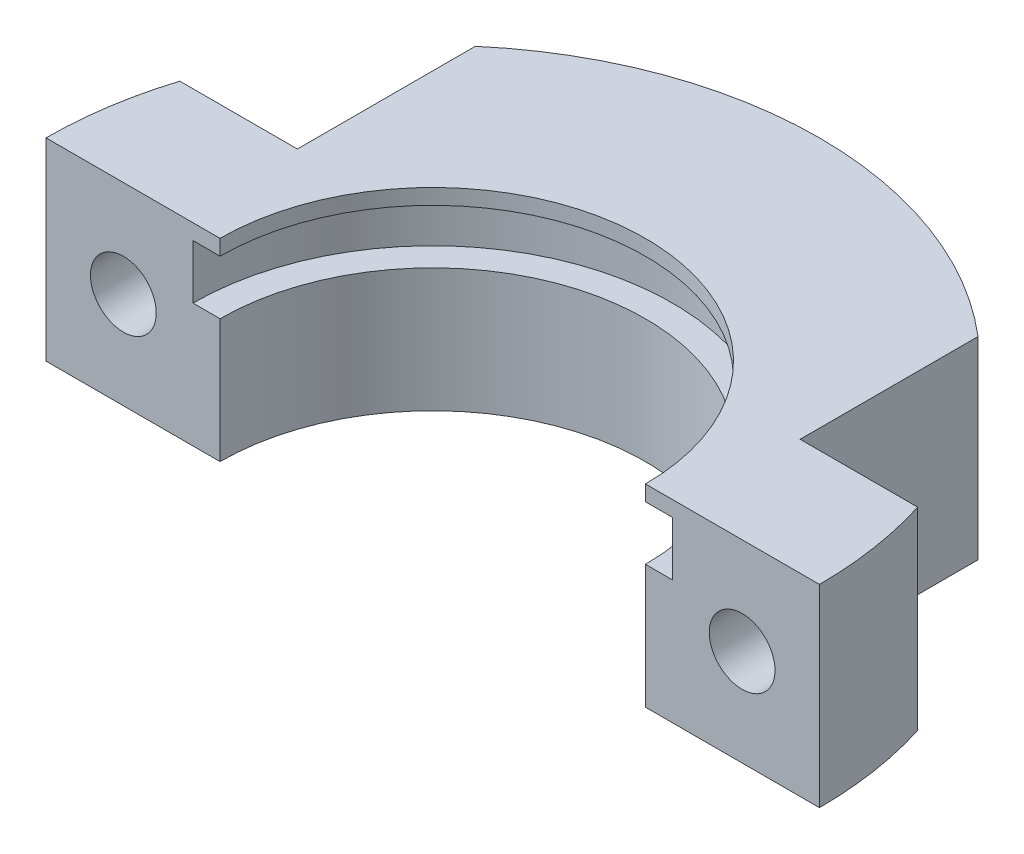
ISO-10303-21;
HEADER;
FILE_DESCRIPTION(('STEP AP214'),'2;1');
FILE_NAME('part.step','',(''),(''),'','','');
FILE_SCHEMA(('AUTOMOTIVE_DESIGN { 1 0 10303 214 1 1 1 1 }'));
ENDSEC;
DATA;
#1=APPLICATION_CONTEXT('core data for automotive mechanical design processes');
#2=APPLICATION_PROTOCOL_DEFINITION('international standard','automotive_design',2000,#1);
#3=PRODUCT_CONTEXT('',#1,'mechanical');
#4=PRODUCT('Part','Part','',(#3));
#5=PRODUCT_RELATED_PRODUCT_CATEGORY('part','',(#4));
#6=PRODUCT_DEFINITION_FORMATION('','',#4);
#7=PRODUCT_DEFINITION_CONTEXT('part definition',#1,'design');
#8=PRODUCT_DEFINITION('design','',#6,#7);
#9=PRODUCT_DEFINITION_SHAPE('','',#8);
#10=(LENGTH_UNIT() NAMED_UNIT(*) SI_UNIT(.MILLI.,.METRE.));
#11=(NAMED_UNIT(*) PLANE_ANGLE_UNIT() SI_UNIT($,.RADIAN.));
#12=(NAMED_UNIT(*) SI_UNIT($,.STERADIAN.) SOLID_ANGLE_UNIT());
#13=UNCERTAINTY_MEASURE_WITH_UNIT(LENGTH_MEASURE(1.E-05),#10,'distance_accuracy_value','');
#14=(GEOMETRIC_REPRESENTATION_CONTEXT(3) GLOBAL_UNCERTAINTY_ASSIGNED_CONTEXT((#13)) GLOBAL_UNIT_ASSIGNED_CONTEXT((#10,
#11,#12)) REPRESENTATION_CONTEXT('',''));
#15=CARTESIAN_POINT('',(0.,0.,0.));
#16=DIRECTION('',(0.,0.,1.));
#17=DIRECTION('',(1.,0.,0.));
#18=AXIS2_PLACEMENT_3D('',#15,#16,#17);
#19=CARTESIAN_POINT('',(0.,50.,0.));
#20=DIRECTION('',(0.,-1.,0.));
#21=DIRECTION('',(0.,0.,-1.));
#22=AXIS2_PLACEMENT_3D('',#19,#20,#21);
#23=CYLINDRICAL_SURFACE('',#22,100.);
#24=DIRECTION('',(0.,-1.,0.));
#25=VECTOR('',#24,1.);
#26=CARTESIAN_POINT('',(-65.,50.,-75.9934207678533));
#27=LINE('',#26,#25);
#28=CARTESIAN_POINT('',(-65.,0.,-75.9934207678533));
#29=VERTEX_POINT('',#28);
#30=CARTESIAN_POINT('',(-65.,50.,-75.9934207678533));
#31=VERTEX_POINT('',#30);
#32=EDGE_CURVE('E134',#29,#31,#27,.F.);
#33=ORIENTED_EDGE('',*,*,#32,.T.);
#34=CARTESIAN_POINT('',(0.,50.,0.));
#35=DIRECTION('',(0.,1.,0.));
#36=DIRECTION('',(0.,0.,1.));
#37=AXIS2_PLACEMENT_3D('',#34,#35,#36);
#38=CIRCLE('',#37,100.);
#39=CARTESIAN_POINT('',(65.,50.,-75.9934207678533));
#40=VERTEX_POINT('',#39);
#41=EDGE_CURVE('E145',#40,#31,#38,.T.);
#42=ORIENTED_EDGE('',*,*,#41,.F.);
#43=DIRECTION('',(0.,-1.,0.));
#44=VECTOR('',#43,1.);
#45=CARTESIAN_POINT('',(65.,50.,-75.9934207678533));
#46=LINE('',#45,#44);
#47=CARTESIAN_POINT('',(65.,0.,-75.9934207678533));
#48=VERTEX_POINT('',#47);
#49=EDGE_CURVE('E248',#48,#40,#46,.F.);
#50=ORIENTED_EDGE('',*,*,#49,.F.);
#51=CARTESIAN_POINT('',(0.,0.,0.));
#52=DIRECTION('',(0.,1.,0.));
#53=DIRECTION('',(0.,0.,1.));
#54=AXIS2_PLACEMENT_3D('',#51,#52,#53);
#55=CIRCLE('',#54,100.);
#56=EDGE_CURVE('E147',#48,#29,#55,.T.);
#57=ORIENTED_EDGE('',*,*,#56,.T.);
#58=EDGE_LOOP('',(#33,#42,#50,#57));
#59=FACE_BOUND('',#58,.T.);
#60=ADVANCED_FACE('F32',(#59),#23,.T.);
#61=DIRECTION('',(0.,-1.,0.));
#62=VECTOR('',#61,1.);
#63=CARTESIAN_POINT('',(-95.3939201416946,50.,-30.));
#64=LINE('',#63,#62);
#65=CARTESIAN_POINT('',(-95.3939201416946,50.,-30.));
#66=VERTEX_POINT('',#65);
#67=CARTESIAN_POINT('',(-95.3939201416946,0.,-30.));
#68=VERTEX_POINT('',#67);
#69=EDGE_CURVE('E149',#66,#68,#64,.T.);
#70=ORIENTED_EDGE('',*,*,#69,.T.);
#71=CARTESIAN_POINT('',(-100.,0.,0.));
#72=VERTEX_POINT('',#71);
#73=EDGE_CURVE('E171',#68,#72,#55,.T.);
#74=ORIENTED_EDGE('',*,*,#73,.T.);
#75=DIRECTION('',(0.,-1.,0.));
#76=VECTOR('',#75,1.);
#77=CARTESIAN_POINT('',(-100.,50.,0.));
#78=LINE('',#77,#76);
#79=CARTESIAN_POINT('',(-100.,50.,0.));
#80=VERTEX_POINT('',#79);
#81=EDGE_CURVE('E187',#80,#72,#78,.T.);
#82=ORIENTED_EDGE('',*,*,#81,.F.);
#83=EDGE_CURVE('E156',#66,#80,#38,.T.);
#84=ORIENTED_EDGE('',*,*,#83,.F.);
#85=EDGE_LOOP('',(#70,#74,#82,#84));
#86=FACE_BOUND('',#85,.T.);
#87=ADVANCED_FACE('F304',(#86),#23,.T.);
#88=CARTESIAN_POINT('',(-174.066692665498,50.,-50.));
#89=DIRECTION('',(0.,1.,0.));
#90=DIRECTION('',(0.,0.,1.));
#91=AXIS2_PLACEMENT_3D('',#88,#89,#90);
#92=PLANE('',#91);
#93=ORIENTED_EDGE('',*,*,#41,.T.);
#94=DIRECTION('',(0.,0.,1.));
#95=VECTOR('',#94,1.);
#96=CARTESIAN_POINT('',(-65.,50.,-102.811705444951));
#97=LINE('',#96,#95);
#98=CARTESIAN_POINT('',(-65.,50.,-30.));
#99=VERTEX_POINT('',#98);
#100=EDGE_CURVE('E131',#31,#99,#97,.T.);
#101=ORIENTED_EDGE('',*,*,#100,.T.);
#102=DIRECTION('',(-1.,0.,0.));
#103=VECTOR('',#102,1.);
#104=CARTESIAN_POINT('',(-65.,50.,-30.));
#105=LINE('',#104,#103);
#106=EDGE_CURVE('E139',#99,#66,#105,.T.);
#107=ORIENTED_EDGE('',*,*,#106,.T.);
#108=ORIENTED_EDGE('',*,*,#83,.T.);
#109=DIRECTION('',(-1.,0.,0.));
#110=VECTOR('',#109,1.);
#111=CARTESIAN_POINT('',(-174.066692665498,50.,0.));
#112=LINE('',#111,#110);
#113=CARTESIAN_POINT('',(-55.,50.,0.));
#114=VERTEX_POINT('',#113);
#115=EDGE_CURVE('E159',#114,#80,#112,.T.);
#116=ORIENTED_EDGE('',*,*,#115,.F.);
#117=CARTESIAN_POINT('',(0.,50.,0.));
#118=DIRECTION('',(0.,1.,0.));
#119=DIRECTION('',(0.,0.,1.));
#120=AXIS2_PLACEMENT_3D('',#117,#118,#119);
#121=CIRCLE('',#120,55.);
#122=CARTESIAN_POINT('',(55.,50.,0.));
#123=VERTEX_POINT('',#122);
#124=EDGE_CURVE('E164',#123,#114,#121,.T.);
#125=ORIENTED_EDGE('',*,*,#124,.F.);
#126=CARTESIAN_POINT('',(100.,50.,0.));
#127=VERTEX_POINT('',#126);
#128=EDGE_CURVE('E160',#127,#123,#112,.T.);
#129=ORIENTED_EDGE('',*,*,#128,.F.);
#130=CARTESIAN_POINT('',(95.3939201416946,50.,-30.));
#131=VERTEX_POINT('',#130);
#132=EDGE_CURVE('E155',#127,#131,#38,.T.);
#133=ORIENTED_EDGE('',*,*,#132,.T.);
#134=DIRECTION('',(1.,0.,0.));
#135=VECTOR('',#134,1.);
#136=CARTESIAN_POINT('',(65.,50.,-30.));
#137=LINE('',#136,#135);
#138=CARTESIAN_POINT('',(65.,50.,-30.));
#139=VERTEX_POINT('',#138);
#140=EDGE_CURVE('E241',#139,#131,#137,.T.);
#141=ORIENTED_EDGE('',*,*,#140,.F.);
#142=DIRECTION('',(0.,0.,1.));
#143=VECTOR('',#142,1.);
#144=CARTESIAN_POINT('',(65.,50.,-102.811705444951));
#145=LINE('',#144,#143);
#146=EDGE_CURVE('E154',#40,#139,#145,.T.);
#147=ORIENTED_EDGE('',*,*,#146,.F.);
#148=EDGE_LOOP('',(#93,#101,#107,#108,#116,#125,#129,#133,#141,#147));
#149=FACE_BOUND('',#148,.T.);
#150=ADVANCED_FACE('F152',(#149),#92,.T.);
#151=CARTESIAN_POINT('',(-174.066692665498,0.,-50.));
#152=DIRECTION('',(0.,1.,0.));
#153=DIRECTION('',(0.,0.,1.));
#154=AXIS2_PLACEMENT_3D('',#151,#152,#153);
#155=PLANE('',#154);
#156=DIRECTION('',(0.,0.,-1.));
#157=VECTOR('',#156,1.);
#158=CARTESIAN_POINT('',(-65.,0.,-102.811705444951));
#159=LINE('',#158,#157);
#160=CARTESIAN_POINT('',(-65.,0.,-30.));
#161=VERTEX_POINT('',#160);
#162=EDGE_CURVE('E148',#161,#29,#159,.T.);
#163=ORIENTED_EDGE('',*,*,#162,.T.);
#164=ORIENTED_EDGE('',*,*,#56,.F.);
#165=DIRECTION('',(0.,0.,-1.));
#166=VECTOR('',#165,1.);
#167=CARTESIAN_POINT('',(65.,0.,-102.811705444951));
#168=LINE('',#167,#166);
#169=CARTESIAN_POINT('',(65.,0.,-30.));
#170=VERTEX_POINT('',#169);
#171=EDGE_CURVE('E238',#170,#48,#168,.T.);
#172=ORIENTED_EDGE('',*,*,#171,.F.);
#173=DIRECTION('',(-1.,0.,0.));
#174=VECTOR('',#173,1.);
#175=CARTESIAN_POINT('',(65.,0.,-30.));
#176=LINE('',#175,#174);
#177=CARTESIAN_POINT('',(95.3939201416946,0.,-30.));
#178=VERTEX_POINT('',#177);
#179=EDGE_CURVE('E244',#178,#170,#176,.T.);
#180=ORIENTED_EDGE('',*,*,#179,.F.);
#181=CARTESIAN_POINT('',(100.,0.,0.));
#182=VERTEX_POINT('',#181);
#183=EDGE_CURVE('E174',#182,#178,#55,.T.);
#184=ORIENTED_EDGE('',*,*,#183,.F.);
#185=DIRECTION('',(-1.,0.,0.));
#186=VECTOR('',#185,1.);
#187=CARTESIAN_POINT('',(-174.066692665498,0.,0.));
#188=LINE('',#187,#186);
#189=CARTESIAN_POINT('',(55.,0.,0.));
#190=VERTEX_POINT('',#189);
#191=EDGE_CURVE('E168',#182,#190,#188,.T.);
#192=ORIENTED_EDGE('',*,*,#191,.T.);
#193=CARTESIAN_POINT('',(0.,0.,0.));
#194=DIRECTION('',(0.,1.,0.));
#195=DIRECTION('',(0.,0.,1.));
#196=AXIS2_PLACEMENT_3D('',#193,#194,#195);
#197=CIRCLE('',#196,55.);
#198=CARTESIAN_POINT('',(-55.,0.,0.));
#199=VERTEX_POINT('',#198);
#200=EDGE_CURVE('E177',#190,#199,#197,.T.);
#201=ORIENTED_EDGE('',*,*,#200,.T.);
#202=EDGE_CURVE('E173',#199,#72,#188,.T.);
#203=ORIENTED_EDGE('',*,*,#202,.T.);
#204=ORIENTED_EDGE('',*,*,#73,.F.);
#205=DIRECTION('',(1.,0.,0.));
#206=VECTOR('',#205,1.);
#207=CARTESIAN_POINT('',(-65.,0.,-30.));
#208=LINE('',#207,#206);
#209=EDGE_CURVE('E250',#68,#161,#208,.T.);
#210=ORIENTED_EDGE('',*,*,#209,.T.);
#211=EDGE_LOOP('',(#163,#164,#172,#180,#184,#192,#201,#203,#204,#210));
#212=FACE_BOUND('',#211,.T.);
#213=ADVANCED_FACE('F212',(#212),#155,.F.);
#214=ORIENTED_EDGE('',*,*,#183,.T.);
#215=DIRECTION('',(0.,-1.,0.));
#216=VECTOR('',#215,1.);
#217=CARTESIAN_POINT('',(95.3939201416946,50.,-30.));
#218=LINE('',#217,#216);
#219=EDGE_CURVE('E246',#131,#178,#218,.T.);
#220=ORIENTED_EDGE('',*,*,#219,.F.);
#221=ORIENTED_EDGE('',*,*,#132,.F.);
#222=DIRECTION('',(0.,-1.,0.));
#223=VECTOR('',#222,1.);
#224=CARTESIAN_POINT('',(100.,50.,0.));
#225=LINE('',#224,#223);
#226=EDGE_CURVE('E190',#127,#182,#225,.T.);
#227=ORIENTED_EDGE('',*,*,#226,.T.);
#228=EDGE_LOOP('',(#214,#220,#221,#227));
#229=FACE_BOUND('',#228,.T.);
#230=ADVANCED_FACE('F282',(#229),#23,.T.);
#231=CARTESIAN_POINT('',(-174.066692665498,50.,0.));
#232=DIRECTION('',(0.,0.,1.));
#233=DIRECTION('',(1.,0.,0.));
#234=AXIS2_PLACEMENT_3D('',#231,#232,#233);
#235=PLANE('',#234);
#236=CARTESIAN_POINT('',(80.,25.,0.));
#237=DIRECTION('',(0.,0.,1.));
#238=DIRECTION('',(1.,0.,0.));
#239=AXIS2_PLACEMENT_3D('',#236,#237,#238);
#240=CIRCLE('',#239,8.50000000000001);
#241=CARTESIAN_POINT('',(88.5,25.,0.));
#242=VERTEX_POINT('',#241);
#243=EDGE_CURVE('E265',#242,#242,#240,.F.);
#244=ORIENTED_EDGE('',*,*,#243,.T.);
#245=EDGE_LOOP('',(#244));
#246=FACE_BOUND('',#245,.T.);
#247=DIRECTION('',(0.,1.,0.));
#248=VECTOR('',#247,1.);
#249=CARTESIAN_POINT('',(62.,71.2706644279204,0.));
#250=LINE('',#249,#248);
#251=CARTESIAN_POINT('',(62.,46.,0.));
#252=VERTEX_POINT('',#251);
#253=CARTESIAN_POINT('',(62.,32.,0.));
#254=VERTEX_POINT('',#253);
#255=EDGE_CURVE('E172',#252,#254,#250,.F.);
#256=ORIENTED_EDGE('',*,*,#255,.T.);
#257=DIRECTION('',(-1.,0.,0.));
#258=VECTOR('',#257,1.);
#259=CARTESIAN_POINT('',(-174.066692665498,32.,0.));
#260=LINE('',#259,#258);
#261=CARTESIAN_POINT('',(55.,32.,0.));
#262=VERTEX_POINT('',#261);
#263=EDGE_CURVE('E221',#254,#262,#260,.T.);
#264=ORIENTED_EDGE('',*,*,#263,.T.);
#265=DIRECTION('',(0.,-1.,0.));
#266=VECTOR('',#265,1.);
#267=CARTESIAN_POINT('',(55.,50.,0.));
#268=LINE('',#267,#266);
#269=EDGE_CURVE('E167',#262,#190,#268,.T.);
#270=ORIENTED_EDGE('',*,*,#269,.T.);
#271=ORIENTED_EDGE('',*,*,#191,.F.);
#272=ORIENTED_EDGE('',*,*,#226,.F.);
#273=ORIENTED_EDGE('',*,*,#128,.T.);
#274=CARTESIAN_POINT('',(55.,46.,0.));
#275=VERTEX_POINT('',#274);
#276=EDGE_CURVE('E180',#123,#275,#268,.T.);
#277=ORIENTED_EDGE('',*,*,#276,.T.);
#278=DIRECTION('',(1.,0.,0.));
#279=VECTOR('',#278,1.);
#280=CARTESIAN_POINT('',(-174.066692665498,46.,0.));
#281=LINE('',#280,#279);
#282=EDGE_CURVE('E226',#275,#252,#281,.T.);
#283=ORIENTED_EDGE('',*,*,#282,.T.);
#284=EDGE_LOOP('',(#256,#264,#270,#271,#272,#273,#277,#283));
#285=FACE_BOUND('',#284,.T.);
#286=ADVANCED_FACE('F218',(#246,#285),#235,.T.);
#287=CARTESIAN_POINT('',(-80.,25.,0.));
#288=DIRECTION('',(0.,0.,1.));
#289=DIRECTION('',(1.,0.,0.));
#290=AXIS2_PLACEMENT_3D('',#287,#288,#289);
#291=CIRCLE('',#290,8.50000000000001);
#292=CARTESIAN_POINT('',(-71.5,25.,0.));
#293=VERTEX_POINT('',#292);
#294=EDGE_CURVE('E259',#293,#293,#291,.F.);
#295=ORIENTED_EDGE('',*,*,#294,.T.);
#296=EDGE_LOOP('',(#295));
#297=FACE_BOUND('',#296,.T.);
#298=DIRECTION('',(0.,-1.,0.));
#299=VECTOR('',#298,1.);
#300=CARTESIAN_POINT('',(-55.,50.,0.));
#301=LINE('',#300,#299);
#302=CARTESIAN_POINT('',(-55.,32.,0.));
#303=VERTEX_POINT('',#302);
#304=EDGE_CURVE('E183',#303,#199,#301,.T.);
#305=ORIENTED_EDGE('',*,*,#304,.F.);
#306=DIRECTION('',(-1.,0.,0.));
#307=VECTOR('',#306,1.);
#308=CARTESIAN_POINT('',(-174.066692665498,32.,0.));
#309=LINE('',#308,#307);
#310=CARTESIAN_POINT('',(-62.,32.,0.));
#311=VERTEX_POINT('',#310);
#312=EDGE_CURVE('E206',#303,#311,#309,.T.);
#313=ORIENTED_EDGE('',*,*,#312,.T.);
#314=DIRECTION('',(0.,1.,0.));
#315=VECTOR('',#314,1.);
#316=CARTESIAN_POINT('',(-62.,71.2706644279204,0.));
#317=LINE('',#316,#315);
#318=CARTESIAN_POINT('',(-62.,46.,0.));
#319=VERTEX_POINT('',#318);
#320=EDGE_CURVE('E11',#311,#319,#317,.T.);
#321=ORIENTED_EDGE('',*,*,#320,.T.);
#322=DIRECTION('',(1.,0.,0.));
#323=VECTOR('',#322,1.);
#324=CARTESIAN_POINT('',(-174.066692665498,46.,0.));
#325=LINE('',#324,#323);
#326=CARTESIAN_POINT('',(-55.,46.,0.));
#327=VERTEX_POINT('',#326);
#328=EDGE_CURVE('E230',#319,#327,#325,.T.);
#329=ORIENTED_EDGE('',*,*,#328,.T.);
#330=EDGE_CURVE('E184',#114,#327,#301,.T.);
#331=ORIENTED_EDGE('',*,*,#330,.F.);
#332=ORIENTED_EDGE('',*,*,#115,.T.);
#333=ORIENTED_EDGE('',*,*,#81,.T.);
#334=ORIENTED_EDGE('',*,*,#202,.F.);
#335=EDGE_LOOP('',(#305,#313,#321,#329,#331,#332,#333,#334));
#336=FACE_BOUND('',#335,.T.);
#337=ADVANCED_FACE('F205',(#297,#336),#235,.T.);
#338=CARTESIAN_POINT('',(0.,50.,0.));
#339=DIRECTION('',(0.,-1.,0.));
#340=DIRECTION('',(0.,0.,-1.));
#341=AXIS2_PLACEMENT_3D('',#338,#339,#340);
#342=CYLINDRICAL_SURFACE('',#341,55.);
#343=ORIENTED_EDGE('',*,*,#269,.F.);
#344=CARTESIAN_POINT('',(0.,32.,0.));
#345=DIRECTION('',(0.,1.,0.));
#346=DIRECTION('',(0.,0.,1.));
#347=AXIS2_PLACEMENT_3D('',#344,#345,#346);
#348=CIRCLE('',#347,55.);
#349=EDGE_CURVE('E39',#262,#303,#348,.T.);
#350=ORIENTED_EDGE('',*,*,#349,.T.);
#351=ORIENTED_EDGE('',*,*,#304,.T.);
#352=ORIENTED_EDGE('',*,*,#200,.F.);
#353=EDGE_LOOP('',(#343,#350,#351,#352));
#354=FACE_BOUND('',#353,.T.);
#355=ADVANCED_FACE('F198',(#354),#342,.F.);
#356=ORIENTED_EDGE('',*,*,#330,.T.);
#357=CARTESIAN_POINT('',(0.,46.,0.));
#358=DIRECTION('',(0.,-1.,0.));
#359=DIRECTION('',(0.,0.,-1.));
#360=AXIS2_PLACEMENT_3D('',#357,#358,#359);
#361=CIRCLE('',#360,55.);
#362=EDGE_CURVE('E192',#327,#275,#361,.T.);
#363=ORIENTED_EDGE('',*,*,#362,.T.);
#364=ORIENTED_EDGE('',*,*,#276,.F.);
#365=ORIENTED_EDGE('',*,*,#124,.T.);
#366=EDGE_LOOP('',(#356,#363,#364,#365));
#367=FACE_BOUND('',#366,.T.);
#368=ADVANCED_FACE('F288',(#367),#342,.F.);
#369=CARTESIAN_POINT('',(0.,32.,-31.9145118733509));
#370=DIRECTION('',(0.,1.,0.));
#371=DIRECTION('',(0.,0.,1.));
#372=AXIS2_PLACEMENT_3D('',#369,#370,#371);
#373=PLANE('',#372);
#374=CARTESIAN_POINT('',(0.,32.,0.));
#375=DIRECTION('',(0.,1.,0.));
#376=DIRECTION('',(0.,0.,1.));
#377=AXIS2_PLACEMENT_3D('',#374,#375,#376);
#378=CIRCLE('',#377,62.);
#379=EDGE_CURVE('E233',#254,#311,#378,.T.);
#380=ORIENTED_EDGE('',*,*,#379,.T.);
#381=ORIENTED_EDGE('',*,*,#312,.F.);
#382=ORIENTED_EDGE('',*,*,#349,.F.);
#383=ORIENTED_EDGE('',*,*,#263,.F.);
#384=EDGE_LOOP('',(#380,#381,#382,#383));
#385=FACE_BOUND('',#384,.T.);
#386=ADVANCED_FACE('F293',(#385),#373,.T.);
#387=CARTESIAN_POINT('',(0.,71.2706644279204,0.));
#388=DIRECTION('',(0.,1.,0.));
#389=DIRECTION('',(0.,0.,1.));
#390=AXIS2_PLACEMENT_3D('',#387,#388,#389);
#391=CYLINDRICAL_SURFACE('',#390,62.);
#392=CARTESIAN_POINT('',(0.,46.,0.));
#393=DIRECTION('',(0.,1.,0.));
#394=DIRECTION('',(0.,0.,1.));
#395=AXIS2_PLACEMENT_3D('',#392,#393,#394);
#396=CIRCLE('',#395,62.);
#397=EDGE_CURVE('E235',#252,#319,#396,.T.);
#398=ORIENTED_EDGE('',*,*,#397,.T.);
#399=ORIENTED_EDGE('',*,*,#320,.F.);
#400=ORIENTED_EDGE('',*,*,#379,.F.);
#401=ORIENTED_EDGE('',*,*,#255,.F.);
#402=EDGE_LOOP('',(#398,#399,#400,#401));
#403=FACE_BOUND('',#402,.T.);
#404=ADVANCED_FACE('F292',(#403),#391,.F.);
#405=CARTESIAN_POINT('',(0.,46.,-31.9145118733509));
#406=DIRECTION('',(0.,-1.,0.));
#407=DIRECTION('',(0.,0.,-1.));
#408=AXIS2_PLACEMENT_3D('',#405,#406,#407);
#409=PLANE('',#408);
#410=ORIENTED_EDGE('',*,*,#362,.F.);
#411=ORIENTED_EDGE('',*,*,#328,.F.);
#412=ORIENTED_EDGE('',*,*,#397,.F.);
#413=ORIENTED_EDGE('',*,*,#282,.F.);
#414=EDGE_LOOP('',(#410,#411,#412,#413));
#415=FACE_BOUND('',#414,.T.);
#416=ADVANCED_FACE('F277',(#415),#409,.T.);
#417=CARTESIAN_POINT('',(65.,-0.001000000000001,-30.));
#418=DIRECTION('',(0.,0.,1.));
#419=DIRECTION('',(1.,0.,0.));
#420=AXIS2_PLACEMENT_3D('',#417,#418,#419);
#421=PLANE('',#420);
#422=CARTESIAN_POINT('',(80.,25.,-30.));
#423=DIRECTION('',(0.,0.,-1.));
#424=DIRECTION('',(1.,0.,0.));
#425=AXIS2_PLACEMENT_3D('',#422,#423,#424);
#426=CIRCLE('',#425,8.50000000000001);
#427=CARTESIAN_POINT('',(88.5,25.,-30.));
#428=VERTEX_POINT('',#427);
#429=EDGE_CURVE('E262',#428,#428,#426,.T.);
#430=ORIENTED_EDGE('',*,*,#429,.F.);
#431=EDGE_LOOP('',(#430));
#432=FACE_BOUND('',#431,.T.);
#433=ORIENTED_EDGE('',*,*,#219,.T.);
#434=ORIENTED_EDGE('',*,*,#179,.T.);
#435=DIRECTION('',(0.,1.,0.));
#436=VECTOR('',#435,1.);
#437=CARTESIAN_POINT('',(65.,-0.001000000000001,-30.));
#438=LINE('',#437,#436);
#439=EDGE_CURVE('E54',#170,#139,#438,.T.);
#440=ORIENTED_EDGE('',*,*,#439,.T.);
#441=ORIENTED_EDGE('',*,*,#140,.T.);
#442=EDGE_LOOP('',(#433,#434,#440,#441));
#443=FACE_BOUND('',#442,.T.);
#444=ADVANCED_FACE('F273',(#432,#443),#421,.F.);
#445=CARTESIAN_POINT('',(65.,-0.001000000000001,-102.811705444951));
#446=DIRECTION('',(-1.,0.,0.));
#447=DIRECTION('',(0.,0.,1.));
#448=AXIS2_PLACEMENT_3D('',#445,#446,#447);
#449=PLANE('',#448);
#450=ORIENTED_EDGE('',*,*,#49,.T.);
#451=ORIENTED_EDGE('',*,*,#146,.T.);
#452=ORIENTED_EDGE('',*,*,#439,.F.);
#453=ORIENTED_EDGE('',*,*,#171,.T.);
#454=EDGE_LOOP('',(#450,#451,#452,#453));
#455=FACE_BOUND('',#454,.T.);
#456=ADVANCED_FACE('F276',(#455),#449,.F.);
#457=CARTESIAN_POINT('',(-65.,-0.001000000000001,-102.811705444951));
#458=DIRECTION('',(-1.,0.,0.));
#459=DIRECTION('',(0.,0.,1.));
#460=AXIS2_PLACEMENT_3D('',#457,#458,#459);
#461=PLANE('',#460);
#462=ORIENTED_EDGE('',*,*,#162,.F.);
#463=DIRECTION('',(0.,1.,0.));
#464=VECTOR('',#463,1.);
#465=CARTESIAN_POINT('',(-65.,-0.001000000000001,-30.));
#466=LINE('',#465,#464);
#467=EDGE_CURVE('E46',#161,#99,#466,.T.);
#468=ORIENTED_EDGE('',*,*,#467,.T.);
#469=ORIENTED_EDGE('',*,*,#100,.F.);
#470=ORIENTED_EDGE('',*,*,#32,.F.);
#471=EDGE_LOOP('',(#462,#468,#469,#470));
#472=FACE_BOUND('',#471,.T.);
#473=ADVANCED_FACE('F133',(#472),#461,.T.);
#474=CARTESIAN_POINT('',(-65.,-0.001000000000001,-30.));
#475=DIRECTION('',(0.,0.,-1.));
#476=DIRECTION('',(-1.,0.,0.));
#477=AXIS2_PLACEMENT_3D('',#474,#475,#476);
#478=PLANE('',#477);
#479=CARTESIAN_POINT('',(-80.,25.,-30.));
#480=DIRECTION('',(0.,0.,-1.));
#481=DIRECTION('',(-1.,0.,0.));
#482=AXIS2_PLACEMENT_3D('',#479,#480,#481);
#483=CIRCLE('',#482,8.50000000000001);
#484=CARTESIAN_POINT('',(-88.5,25.,-30.));
#485=VERTEX_POINT('',#484);
#486=EDGE_CURVE('E258',#485,#485,#483,.T.);
#487=ORIENTED_EDGE('',*,*,#486,.F.);
#488=EDGE_LOOP('',(#487));
#489=FACE_BOUND('',#488,.T.);
#490=ORIENTED_EDGE('',*,*,#106,.F.);
#491=ORIENTED_EDGE('',*,*,#467,.F.);
#492=ORIENTED_EDGE('',*,*,#209,.F.);
#493=ORIENTED_EDGE('',*,*,#69,.F.);
#494=EDGE_LOOP('',(#490,#491,#492,#493));
#495=FACE_BOUND('',#494,.T.);
#496=ADVANCED_FACE('F331',(#489,#495),#478,.T.);
#497=CARTESIAN_POINT('',(-80.,25.,0.001000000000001));
#498=DIRECTION('',(0.,0.,-1.));
#499=DIRECTION('',(-1.,0.,0.));
#500=AXIS2_PLACEMENT_3D('',#497,#498,#499);
#501=CYLINDRICAL_SURFACE('',#500,8.50000000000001);
#502=ORIENTED_EDGE('',*,*,#294,.F.);
#503=EDGE_LOOP('',(#502));
#504=FACE_BOUND('',#503,.T.);
#505=ORIENTED_EDGE('',*,*,#486,.T.);
#506=EDGE_LOOP('',(#505));
#507=FACE_BOUND('',#506,.T.);
#508=ADVANCED_FACE('F328',(#504,#507),#501,.F.);
#509=CARTESIAN_POINT('',(80.,25.,0.001000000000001));
#510=DIRECTION('',(0.,0.,-1.));
#511=DIRECTION('',(-1.,0.,0.));
#512=AXIS2_PLACEMENT_3D('',#509,#510,#511);
#513=CYLINDRICAL_SURFACE('',#512,8.50000000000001);
#514=ORIENTED_EDGE('',*,*,#243,.F.);
#515=EDGE_LOOP('',(#514));
#516=FACE_BOUND('',#515,.T.);
#517=ORIENTED_EDGE('',*,*,#429,.T.);
#518=EDGE_LOOP('',(#517));
#519=FACE_BOUND('',#518,.T.);
#520=ADVANCED_FACE('F271',(#516,#519),#513,.F.);
#521=CLOSED_SHELL('',(#60,#87,#150,#213,#230,#286,#337,#355,#368,#386,#404,#416,#444,#456,#473,
#496,#508,#520));
#522=MANIFOLD_SOLID_BREP('B2',#521);
#523=ADVANCED_BREP_SHAPE_REPRESENTATION('',(#18,#522),#14);
#524=SHAPE_DEFINITION_REPRESENTATION(#9,#523);
ENDSEC;
END-ISO-10303-21;
